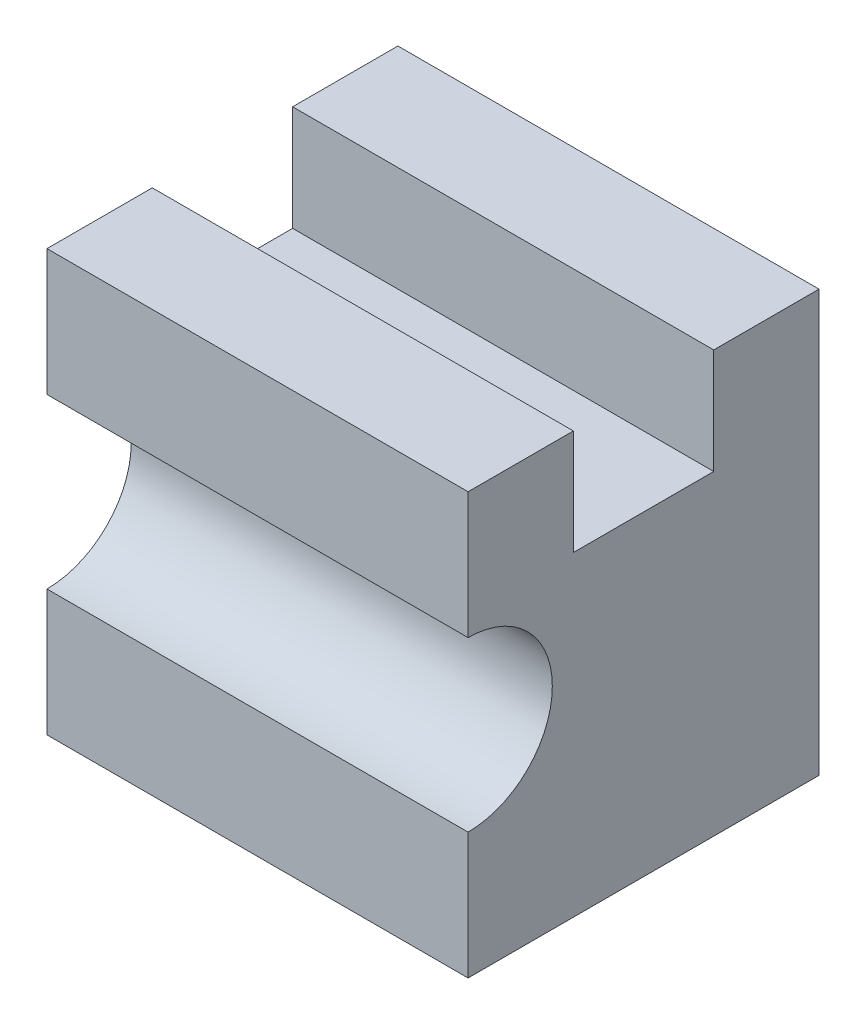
ISO-10303-21;
HEADER;
FILE_DESCRIPTION(('STEP AP214'),'2;1');
FILE_NAME('part.step','',(''),(''),'','','');
FILE_SCHEMA(('AUTOMOTIVE_DESIGN { 1 0 10303 214 1 1 1 1 }'));
ENDSEC;
DATA;
#1=APPLICATION_CONTEXT('core data for automotive mechanical design processes');
#2=APPLICATION_PROTOCOL_DEFINITION('international standard','automotive_design',2000,#1);
#3=PRODUCT_CONTEXT('',#1,'mechanical');
#4=PRODUCT('Part','Part','',(#3));
#5=PRODUCT_RELATED_PRODUCT_CATEGORY('part','',(#4));
#6=PRODUCT_DEFINITION_FORMATION('','',#4);
#7=PRODUCT_DEFINITION_CONTEXT('part definition',#1,'design');
#8=PRODUCT_DEFINITION('design','',#6,#7);
#9=PRODUCT_DEFINITION_SHAPE('','',#8);
#10=(LENGTH_UNIT() NAMED_UNIT(*) SI_UNIT(.MILLI.,.METRE.));
#11=(NAMED_UNIT(*) PLANE_ANGLE_UNIT() SI_UNIT($,.RADIAN.));
#12=(NAMED_UNIT(*) SI_UNIT($,.STERADIAN.) SOLID_ANGLE_UNIT());
#13=UNCERTAINTY_MEASURE_WITH_UNIT(LENGTH_MEASURE(1.E-05),#10,'distance_accuracy_value','');
#14=(GEOMETRIC_REPRESENTATION_CONTEXT(3) GLOBAL_UNCERTAINTY_ASSIGNED_CONTEXT((#13)) GLOBAL_UNIT_ASSIGNED_CONTEXT((#10,
#11,#12)) REPRESENTATION_CONTEXT('',''));
#15=CARTESIAN_POINT('',(0.,0.,0.));
#16=DIRECTION('',(0.,0.,1.));
#17=DIRECTION('',(1.,0.,0.));
#18=AXIS2_PLACEMENT_3D('',#15,#16,#17);
#19=CARTESIAN_POINT('',(30.,0.,-50.));
#20=DIRECTION('',(0.,1.,0.));
#21=DIRECTION('',(0.,0.,1.));
#22=AXIS2_PLACEMENT_3D('',#19,#20,#21);
#23=PLANE('',#22);
#24=DIRECTION('',(0.,0.,-1.));
#25=VECTOR('',#24,1.);
#26=CARTESIAN_POINT('',(-30.,0.,-50.));
#27=LINE('',#26,#25);
#28=CARTESIAN_POINT('',(-30.,0.,0.));
#29=VERTEX_POINT('',#28);
#30=CARTESIAN_POINT('',(-30.,0.,-50.));
#31=VERTEX_POINT('',#30);
#32=EDGE_CURVE('E113',#29,#31,#27,.T.);
#33=ORIENTED_EDGE('',*,*,#32,.T.);
#34=DIRECTION('',(-1.,0.,0.));
#35=VECTOR('',#34,1.);
#36=CARTESIAN_POINT('',(30.,0.,-50.));
#37=LINE('',#36,#35);
#38=CARTESIAN_POINT('',(30.,0.,-50.));
#39=VERTEX_POINT('',#38);
#40=EDGE_CURVE('E11',#39,#31,#37,.T.);
#41=ORIENTED_EDGE('',*,*,#40,.F.);
#42=DIRECTION('',(0.,0.,-1.));
#43=VECTOR('',#42,1.);
#44=CARTESIAN_POINT('',(30.,0.,-50.));
#45=LINE('',#44,#43);
#46=CARTESIAN_POINT('',(30.,0.,0.));
#47=VERTEX_POINT('',#46);
#48=EDGE_CURVE('E144',#47,#39,#45,.T.);
#49=ORIENTED_EDGE('',*,*,#48,.F.);
#50=DIRECTION('',(-1.,0.,0.));
#51=VECTOR('',#50,1.);
#52=CARTESIAN_POINT('',(30.,0.,0.));
#53=LINE('',#52,#51);
#54=EDGE_CURVE('E126',#47,#29,#53,.T.);
#55=ORIENTED_EDGE('',*,*,#54,.T.);
#56=EDGE_LOOP('',(#33,#41,#49,#55));
#57=FACE_BOUND('',#56,.T.);
#58=ADVANCED_FACE('F33',(#57),#23,.F.);
#59=CARTESIAN_POINT('',(30.,60.,-50.));
#60=DIRECTION('',(0.,0.,1.));
#61=DIRECTION('',(0.,-1.,0.));
#62=AXIS2_PLACEMENT_3D('',#59,#60,#61);
#63=PLANE('',#62);
#64=DIRECTION('',(0.,1.,0.));
#65=VECTOR('',#64,1.);
#66=CARTESIAN_POINT('',(-30.,60.,-50.));
#67=LINE('',#66,#65);
#68=CARTESIAN_POINT('',(-30.,60.,-50.));
#69=VERTEX_POINT('',#68);
#70=EDGE_CURVE('E109',#31,#69,#67,.T.);
#71=ORIENTED_EDGE('',*,*,#70,.T.);
#72=DIRECTION('',(-1.,0.,0.));
#73=VECTOR('',#72,1.);
#74=CARTESIAN_POINT('',(30.,60.,-50.));
#75=LINE('',#74,#73);
#76=CARTESIAN_POINT('',(30.,60.,-50.));
#77=VERTEX_POINT('',#76);
#78=EDGE_CURVE('E40',#77,#69,#75,.T.);
#79=ORIENTED_EDGE('',*,*,#78,.F.);
#80=DIRECTION('',(0.,1.,0.));
#81=VECTOR('',#80,1.);
#82=CARTESIAN_POINT('',(30.,60.,-50.));
#83=LINE('',#82,#81);
#84=EDGE_CURVE('E122',#39,#77,#83,.T.);
#85=ORIENTED_EDGE('',*,*,#84,.F.);
#86=ORIENTED_EDGE('',*,*,#40,.T.);
#87=EDGE_LOOP('',(#71,#79,#85,#86));
#88=FACE_BOUND('',#87,.T.);
#89=ADVANCED_FACE('F121',(#88),#63,.F.);
#90=CARTESIAN_POINT('',(30.,60.,-35.));
#91=DIRECTION('',(0.,-1.,0.));
#92=DIRECTION('',(0.,0.,-1.));
#93=AXIS2_PLACEMENT_3D('',#90,#91,#92);
#94=PLANE('',#93);
#95=DIRECTION('',(0.,0.,1.));
#96=VECTOR('',#95,1.);
#97=CARTESIAN_POINT('',(-30.,60.,-35.));
#98=LINE('',#97,#96);
#99=CARTESIAN_POINT('',(-30.,60.,-35.));
#100=VERTEX_POINT('',#99);
#101=EDGE_CURVE('E115',#69,#100,#98,.T.);
#102=ORIENTED_EDGE('',*,*,#101,.T.);
#103=DIRECTION('',(-1.,0.,0.));
#104=VECTOR('',#103,1.);
#105=CARTESIAN_POINT('',(30.,60.,-35.));
#106=LINE('',#105,#104);
#107=CARTESIAN_POINT('',(30.,60.,-35.));
#108=VERTEX_POINT('',#107);
#109=EDGE_CURVE('E180',#108,#100,#106,.T.);
#110=ORIENTED_EDGE('',*,*,#109,.F.);
#111=DIRECTION('',(0.,0.,1.));
#112=VECTOR('',#111,1.);
#113=CARTESIAN_POINT('',(30.,60.,-35.));
#114=LINE('',#113,#112);
#115=EDGE_CURVE('E147',#77,#108,#114,.T.);
#116=ORIENTED_EDGE('',*,*,#115,.F.);
#117=ORIENTED_EDGE('',*,*,#78,.T.);
#118=EDGE_LOOP('',(#102,#110,#116,#117));
#119=FACE_BOUND('',#118,.T.);
#120=ADVANCED_FACE('F184',(#119),#94,.F.);
#121=CARTESIAN_POINT('',(30.,45.,-35.));
#122=DIRECTION('',(0.,0.,-1.));
#123=DIRECTION('',(-1.,0.,0.));
#124=AXIS2_PLACEMENT_3D('',#121,#122,#123);
#125=PLANE('',#124);
#126=DIRECTION('',(0.,-1.,0.));
#127=VECTOR('',#126,1.);
#128=CARTESIAN_POINT('',(-30.,45.,-35.));
#129=LINE('',#128,#127);
#130=CARTESIAN_POINT('',(-30.,45.,-35.));
#131=VERTEX_POINT('',#130);
#132=EDGE_CURVE('E130',#100,#131,#129,.T.);
#133=ORIENTED_EDGE('',*,*,#132,.T.);
#134=DIRECTION('',(-1.,0.,0.));
#135=VECTOR('',#134,1.);
#136=CARTESIAN_POINT('',(30.,45.,-35.));
#137=LINE('',#136,#135);
#138=CARTESIAN_POINT('',(30.,45.,-35.));
#139=VERTEX_POINT('',#138);
#140=EDGE_CURVE('E177',#139,#131,#137,.T.);
#141=ORIENTED_EDGE('',*,*,#140,.F.);
#142=DIRECTION('',(0.,-1.,0.));
#143=VECTOR('',#142,1.);
#144=CARTESIAN_POINT('',(30.,45.,-35.));
#145=LINE('',#144,#143);
#146=EDGE_CURVE('E149',#108,#139,#145,.T.);
#147=ORIENTED_EDGE('',*,*,#146,.F.);
#148=ORIENTED_EDGE('',*,*,#109,.T.);
#149=EDGE_LOOP('',(#133,#141,#147,#148));
#150=FACE_BOUND('',#149,.T.);
#151=ADVANCED_FACE('F192',(#150),#125,.F.);
#152=CARTESIAN_POINT('',(30.,45.,-15.));
#153=DIRECTION('',(0.,-1.,0.));
#154=DIRECTION('',(0.,0.,-1.));
#155=AXIS2_PLACEMENT_3D('',#152,#153,#154);
#156=PLANE('',#155);
#157=DIRECTION('',(0.,0.,1.));
#158=VECTOR('',#157,1.);
#159=CARTESIAN_POINT('',(-30.,45.,-15.));
#160=LINE('',#159,#158);
#161=CARTESIAN_POINT('',(-30.,45.,-15.));
#162=VERTEX_POINT('',#161);
#163=EDGE_CURVE('E132',#131,#162,#160,.T.);
#164=ORIENTED_EDGE('',*,*,#163,.T.);
#165=DIRECTION('',(-1.,0.,0.));
#166=VECTOR('',#165,1.);
#167=CARTESIAN_POINT('',(30.,45.,-15.));
#168=LINE('',#167,#166);
#169=CARTESIAN_POINT('',(30.,45.,-15.));
#170=VERTEX_POINT('',#169);
#171=EDGE_CURVE('E174',#170,#162,#168,.T.);
#172=ORIENTED_EDGE('',*,*,#171,.F.);
#173=DIRECTION('',(0.,0.,1.));
#174=VECTOR('',#173,1.);
#175=CARTESIAN_POINT('',(30.,45.,-15.));
#176=LINE('',#175,#174);
#177=EDGE_CURVE('E151',#139,#170,#176,.T.);
#178=ORIENTED_EDGE('',*,*,#177,.F.);
#179=ORIENTED_EDGE('',*,*,#140,.T.);
#180=EDGE_LOOP('',(#164,#172,#178,#179));
#181=FACE_BOUND('',#180,.T.);
#182=ADVANCED_FACE('F195',(#181),#156,.F.);
#183=CARTESIAN_POINT('',(30.,60.,-15.));
#184=DIRECTION('',(0.,0.,1.));
#185=DIRECTION('',(0.,-1.,0.));
#186=AXIS2_PLACEMENT_3D('',#183,#184,#185);
#187=PLANE('',#186);
#188=DIRECTION('',(0.,1.,0.));
#189=VECTOR('',#188,1.);
#190=CARTESIAN_POINT('',(-30.,60.,-15.));
#191=LINE('',#190,#189);
#192=CARTESIAN_POINT('',(-30.,60.,-15.));
#193=VERTEX_POINT('',#192);
#194=EDGE_CURVE('E134',#162,#193,#191,.T.);
#195=ORIENTED_EDGE('',*,*,#194,.T.);
#196=DIRECTION('',(-1.,0.,0.));
#197=VECTOR('',#196,1.);
#198=CARTESIAN_POINT('',(30.,60.,-15.));
#199=LINE('',#198,#197);
#200=CARTESIAN_POINT('',(30.,60.,-15.));
#201=VERTEX_POINT('',#200);
#202=EDGE_CURVE('E171',#201,#193,#199,.T.);
#203=ORIENTED_EDGE('',*,*,#202,.F.);
#204=DIRECTION('',(0.,1.,0.));
#205=VECTOR('',#204,1.);
#206=CARTESIAN_POINT('',(30.,60.,-15.));
#207=LINE('',#206,#205);
#208=EDGE_CURVE('E153',#170,#201,#207,.T.);
#209=ORIENTED_EDGE('',*,*,#208,.F.);
#210=ORIENTED_EDGE('',*,*,#171,.T.);
#211=EDGE_LOOP('',(#195,#203,#209,#210));
#212=FACE_BOUND('',#211,.T.);
#213=ADVANCED_FACE('F200',(#212),#187,.F.);
#214=CARTESIAN_POINT('',(30.,60.,0.));
#215=DIRECTION('',(0.,-1.,0.));
#216=DIRECTION('',(0.,0.,-1.));
#217=AXIS2_PLACEMENT_3D('',#214,#215,#216);
#218=PLANE('',#217);
#219=DIRECTION('',(0.,0.,1.));
#220=VECTOR('',#219,1.);
#221=CARTESIAN_POINT('',(-30.,60.,0.));
#222=LINE('',#221,#220);
#223=CARTESIAN_POINT('',(-30.,60.,0.));
#224=VERTEX_POINT('',#223);
#225=EDGE_CURVE('E136',#193,#224,#222,.T.);
#226=ORIENTED_EDGE('',*,*,#225,.T.);
#227=DIRECTION('',(-1.,0.,0.));
#228=VECTOR('',#227,1.);
#229=CARTESIAN_POINT('',(30.,60.,0.));
#230=LINE('',#229,#228);
#231=CARTESIAN_POINT('',(30.,60.,0.));
#232=VERTEX_POINT('',#231);
#233=EDGE_CURVE('E168',#232,#224,#230,.T.);
#234=ORIENTED_EDGE('',*,*,#233,.F.);
#235=DIRECTION('',(0.,0.,1.));
#236=VECTOR('',#235,1.);
#237=CARTESIAN_POINT('',(30.,60.,0.));
#238=LINE('',#237,#236);
#239=EDGE_CURVE('E155',#201,#232,#238,.T.);
#240=ORIENTED_EDGE('',*,*,#239,.F.);
#241=ORIENTED_EDGE('',*,*,#202,.T.);
#242=EDGE_LOOP('',(#226,#234,#240,#241));
#243=FACE_BOUND('',#242,.T.);
#244=ADVANCED_FACE('F206',(#243),#218,.F.);
#245=CARTESIAN_POINT('',(30.,42.,0.));
#246=DIRECTION('',(0.,0.,-1.));
#247=DIRECTION('',(-1.,0.,0.));
#248=AXIS2_PLACEMENT_3D('',#245,#246,#247);
#249=PLANE('',#248);
#250=DIRECTION('',(0.,-1.,0.));
#251=VECTOR('',#250,1.);
#252=CARTESIAN_POINT('',(-30.,42.,0.));
#253=LINE('',#252,#251);
#254=CARTESIAN_POINT('',(-30.,42.,0.));
#255=VERTEX_POINT('',#254);
#256=EDGE_CURVE('E138',#224,#255,#253,.T.);
#257=ORIENTED_EDGE('',*,*,#256,.T.);
#258=DIRECTION('',(-1.,0.,0.));
#259=VECTOR('',#258,1.);
#260=CARTESIAN_POINT('',(30.,42.,0.));
#261=LINE('',#260,#259);
#262=CARTESIAN_POINT('',(30.,42.,0.));
#263=VERTEX_POINT('',#262);
#264=EDGE_CURVE('E165',#263,#255,#261,.T.);
#265=ORIENTED_EDGE('',*,*,#264,.F.);
#266=DIRECTION('',(0.,-1.,0.));
#267=VECTOR('',#266,1.);
#268=CARTESIAN_POINT('',(30.,42.,0.));
#269=LINE('',#268,#267);
#270=EDGE_CURVE('E157',#232,#263,#269,.T.);
#271=ORIENTED_EDGE('',*,*,#270,.F.);
#272=ORIENTED_EDGE('',*,*,#233,.T.);
#273=EDGE_LOOP('',(#257,#265,#271,#272));
#274=FACE_BOUND('',#273,.T.);
#275=ADVANCED_FACE('F210',(#274),#249,.F.);
#276=CARTESIAN_POINT('',(30.,30.,0.));
#277=DIRECTION('',(-1.,0.,0.));
#278=DIRECTION('',(0.,0.,1.));
#279=AXIS2_PLACEMENT_3D('',#276,#277,#278);
#280=CYLINDRICAL_SURFACE('',#279,12.);
#281=CARTESIAN_POINT('',(-30.,30.,0.));
#282=DIRECTION('',(-1.,0.,0.));
#283=DIRECTION('',(0.,0.,-1.));
#284=AXIS2_PLACEMENT_3D('',#281,#282,#283);
#285=CIRCLE('',#284,12.);
#286=CARTESIAN_POINT('',(-30.,18.,0.));
#287=VERTEX_POINT('',#286);
#288=EDGE_CURVE('E140',#255,#287,#285,.T.);
#289=ORIENTED_EDGE('',*,*,#288,.T.);
#290=DIRECTION('',(-1.,0.,0.));
#291=VECTOR('',#290,1.);
#292=CARTESIAN_POINT('',(30.,18.,0.));
#293=LINE('',#292,#291);
#294=CARTESIAN_POINT('',(30.,18.,0.));
#295=VERTEX_POINT('',#294);
#296=EDGE_CURVE('E162',#295,#287,#293,.T.);
#297=ORIENTED_EDGE('',*,*,#296,.F.);
#298=CARTESIAN_POINT('',(30.,30.,0.));
#299=DIRECTION('',(-1.,0.,0.));
#300=DIRECTION('',(0.,0.,-1.));
#301=AXIS2_PLACEMENT_3D('',#298,#299,#300);
#302=CIRCLE('',#301,12.);
#303=EDGE_CURVE('E52',#263,#295,#302,.T.);
#304=ORIENTED_EDGE('',*,*,#303,.F.);
#305=ORIENTED_EDGE('',*,*,#264,.T.);
#306=EDGE_LOOP('',(#289,#297,#304,#305));
#307=FACE_BOUND('',#306,.T.);
#308=ADVANCED_FACE('F213',(#307),#280,.F.);
#309=CARTESIAN_POINT('',(30.,0.,0.));
#310=DIRECTION('',(0.,0.,-1.));
#311=DIRECTION('',(-1.,0.,0.));
#312=AXIS2_PLACEMENT_3D('',#309,#310,#311);
#313=PLANE('',#312);
#314=DIRECTION('',(0.,-1.,0.));
#315=VECTOR('',#314,1.);
#316=CARTESIAN_POINT('',(-30.,0.,0.));
#317=LINE('',#316,#315);
#318=EDGE_CURVE('E142',#287,#29,#317,.T.);
#319=ORIENTED_EDGE('',*,*,#318,.T.);
#320=ORIENTED_EDGE('',*,*,#54,.F.);
#321=DIRECTION('',(0.,-1.,0.));
#322=VECTOR('',#321,1.);
#323=CARTESIAN_POINT('',(30.,0.,0.));
#324=LINE('',#323,#322);
#325=EDGE_CURVE('E47',#295,#47,#324,.T.);
#326=ORIENTED_EDGE('',*,*,#325,.F.);
#327=ORIENTED_EDGE('',*,*,#296,.T.);
#328=EDGE_LOOP('',(#319,#320,#326,#327));
#329=FACE_BOUND('',#328,.T.);
#330=ADVANCED_FACE('F215',(#329),#313,.F.);
#331=CARTESIAN_POINT('',(30.,30.,0.));
#332=DIRECTION('',(1.,0.,0.));
#333=DIRECTION('',(0.,0.,-1.));
#334=AXIS2_PLACEMENT_3D('',#331,#332,#333);
#335=PLANE('',#334);
#336=ORIENTED_EDGE('',*,*,#48,.T.);
#337=ORIENTED_EDGE('',*,*,#84,.T.);
#338=ORIENTED_EDGE('',*,*,#115,.T.);
#339=ORIENTED_EDGE('',*,*,#146,.T.);
#340=ORIENTED_EDGE('',*,*,#177,.T.);
#341=ORIENTED_EDGE('',*,*,#208,.T.);
#342=ORIENTED_EDGE('',*,*,#239,.T.);
#343=ORIENTED_EDGE('',*,*,#270,.T.);
#344=ORIENTED_EDGE('',*,*,#303,.T.);
#345=ORIENTED_EDGE('',*,*,#325,.T.);
#346=EDGE_LOOP('',(#336,#337,#338,#339,#340,#341,#342,#343,#344,#345));
#347=FACE_BOUND('',#346,.T.);
#348=ADVANCED_FACE('F187',(#347),#335,.T.);
#349=CARTESIAN_POINT('',(-30.,30.,0.));
#350=DIRECTION('',(1.,0.,0.));
#351=DIRECTION('',(0.,0.,-1.));
#352=AXIS2_PLACEMENT_3D('',#349,#350,#351);
#353=PLANE('',#352);
#354=ORIENTED_EDGE('',*,*,#32,.F.);
#355=ORIENTED_EDGE('',*,*,#318,.F.);
#356=ORIENTED_EDGE('',*,*,#288,.F.);
#357=ORIENTED_EDGE('',*,*,#256,.F.);
#358=ORIENTED_EDGE('',*,*,#225,.F.);
#359=ORIENTED_EDGE('',*,*,#194,.F.);
#360=ORIENTED_EDGE('',*,*,#163,.F.);
#361=ORIENTED_EDGE('',*,*,#132,.F.);
#362=ORIENTED_EDGE('',*,*,#101,.F.);
#363=ORIENTED_EDGE('',*,*,#70,.F.);
#364=EDGE_LOOP('',(#354,#355,#356,#357,#358,#359,#360,#361,#362,#363));
#365=FACE_BOUND('',#364,.T.);
#366=ADVANCED_FACE('F110',(#365),#353,.F.);
#367=CLOSED_SHELL('',(#58,#89,#120,#151,#182,#213,#244,#275,#308,#330,#348,#366));
#368=MANIFOLD_SOLID_BREP('B2',#367);
#369=ADVANCED_BREP_SHAPE_REPRESENTATION('',(#18,#368),#14);
#370=SHAPE_DEFINITION_REPRESENTATION(#9,#369);
ENDSEC;
END-ISO-10303-21;
